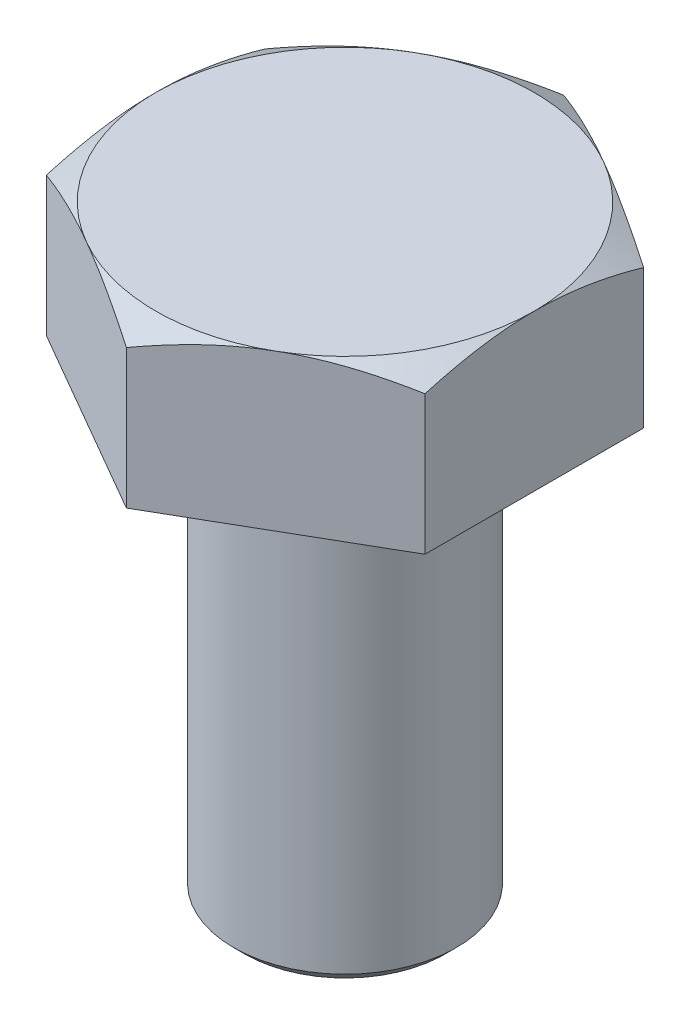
ISO-10303-21;
HEADER;
FILE_DESCRIPTION(('STEP AP214'),'2;1');
FILE_NAME('part.step','',(''),(''),'','','');
FILE_SCHEMA(('AUTOMOTIVE_DESIGN { 1 0 10303 214 1 1 1 1 }'));
ENDSEC;
DATA;
#1=APPLICATION_CONTEXT('core data for automotive mechanical design processes');
#2=APPLICATION_PROTOCOL_DEFINITION('international standard','automotive_design',2000,#1);
#3=PRODUCT_CONTEXT('',#1,'mechanical');
#4=PRODUCT('Part','Part','',(#3));
#5=PRODUCT_RELATED_PRODUCT_CATEGORY('part','',(#4));
#6=PRODUCT_DEFINITION_FORMATION('','',#4);
#7=PRODUCT_DEFINITION_CONTEXT('part definition',#1,'design');
#8=PRODUCT_DEFINITION('design','',#6,#7);
#9=PRODUCT_DEFINITION_SHAPE('','',#8);
#10=(LENGTH_UNIT() NAMED_UNIT(*) SI_UNIT(.MILLI.,.METRE.));
#11=(NAMED_UNIT(*) PLANE_ANGLE_UNIT() SI_UNIT($,.RADIAN.));
#12=(NAMED_UNIT(*) SI_UNIT($,.STERADIAN.) SOLID_ANGLE_UNIT());
#13=UNCERTAINTY_MEASURE_WITH_UNIT(LENGTH_MEASURE(1.E-05),#10,'distance_accuracy_value','');
#14=(GEOMETRIC_REPRESENTATION_CONTEXT(3) GLOBAL_UNCERTAINTY_ASSIGNED_CONTEXT((#13)) GLOBAL_UNIT_ASSIGNED_CONTEXT((#10,
#11,#12)) REPRESENTATION_CONTEXT('',''));
#15=CARTESIAN_POINT('',(0.,0.,0.));
#16=DIRECTION('',(0.,0.,1.));
#17=DIRECTION('',(1.,0.,0.));
#18=AXIS2_PLACEMENT_3D('',#15,#16,#17);
#19=CARTESIAN_POINT('',(8.49999999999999,7.,-4.90747728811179));
#20=DIRECTION('',(-0.5,0.,0.866025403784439));
#21=DIRECTION('',(0.866025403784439,0.,0.5));
#22=AXIS2_PLACEMENT_3D('',#19,#20,#21);
#23=PLANE('',#22);
#24=DIRECTION('',(0.,-1.,0.));
#25=VECTOR('',#24,1.);
#26=CARTESIAN_POINT('',(0.,7.,-9.81495457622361));
#27=LINE('',#26,#25);
#28=CARTESIAN_POINT('',(0.,6.24081062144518,-9.81495457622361));
#29=VERTEX_POINT('',#28);
#30=CARTESIAN_POINT('',(0.,0.,-9.81495457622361));
#31=VERTEX_POINT('',#30);
#32=EDGE_CURVE('E120',#29,#31,#27,.T.);
#33=ORIENTED_EDGE('',*,*,#32,.F.);
#34=CARTESIAN_POINT('',(-0.000200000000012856,6.24074395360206,-9.81507004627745));
#35=CARTESIAN_POINT('',(0.186639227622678,6.3030138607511,-9.70719836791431));
#36=CARTESIAN_POINT('',(0.374175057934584,6.36245770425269,-9.59892450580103));
#37=CARTESIAN_POINT('',(0.750769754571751,6.47491488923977,-9.38149745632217));
#38=CARTESIAN_POINT('',(0.939829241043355,6.52792545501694,-9.27234391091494));
#39=CARTESIAN_POINT('',(1.51003475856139,6.67626661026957,-8.9431356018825));
#40=CARTESIAN_POINT('',(1.89343164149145,6.76064107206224,-8.72178130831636));
#41=CARTESIAN_POINT('',(2.46717766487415,6.85957998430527,-8.39052888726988));
#42=CARTESIAN_POINT('',(2.65581276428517,6.88776480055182,-8.28162036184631));
#43=CARTESIAN_POINT('',(3.0339360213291,6.93502591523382,-8.06331079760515));
#44=CARTESIAN_POINT('',(3.22342410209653,6.95410301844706,-7.95390980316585));
#45=CARTESIAN_POINT('',(3.60272652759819,6.98266522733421,-7.73491944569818));
#46=CARTESIAN_POINT('',(3.79254025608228,6.99216121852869,-7.62533043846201));
#47=CARTESIAN_POINT('',(4.17234305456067,7.00135762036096,-7.40605119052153));
#48=CARTESIAN_POINT('',(4.36233211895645,7.00105833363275,-7.29636095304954));
#49=CARTESIAN_POINT('',(4.71752301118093,6.99134552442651,-7.09129139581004));
#50=CARTESIAN_POINT('',(4.88274990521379,6.98311683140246,-6.99589760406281));
#51=CARTESIAN_POINT('',(5.21281671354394,6.95941075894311,-6.80533344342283));
#52=CARTESIAN_POINT('',(5.37765660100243,6.94393289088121,-6.71016309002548));
#53=CARTESIAN_POINT('',(5.8715381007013,6.88699137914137,-6.42502047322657));
#54=CARTESIAN_POINT('',(6.1997055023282,6.8350269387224,-6.23555293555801));
#55=CARTESIAN_POINT('',(6.85952142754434,6.70511505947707,-5.85460803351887));
#56=CARTESIAN_POINT('',(7.19108574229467,6.62661693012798,-5.6631792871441));
#57=CARTESIAN_POINT('',(7.84926989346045,6.44845866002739,-5.28317649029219));
#58=CARTESIAN_POINT('',(8.17589815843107,6.34884036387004,-5.09459757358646));
#59=CARTESIAN_POINT('',(8.50019999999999,6.24074395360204,-4.90736181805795));
#60=B_SPLINE_CURVE_WITH_KNOTS('',3,(#34,#35,#36,#37,#38,#39,#40,#41,#42,#43,#44,#45,#46,#47,#48,
#49,#50,#51,#52,#53,#54,#55,#56,#57,#58,#59),.UNSPECIFIED.,.F.,.F.,(4,2,2,2,2,2,2,2,2,2,2,2,4),
(0.,0.673596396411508,1.34748239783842,2.69805431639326,3.356799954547,4.01548737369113,
4.67342558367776,5.33134346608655,5.90409556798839,6.47688628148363,7.62328361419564,
8.79510569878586,9.9646274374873),.UNSPECIFIED.);
#61=CARTESIAN_POINT('',(4.25000000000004,7.,-7.36121593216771));
#62=VERTEX_POINT('',#61);
#63=EDGE_CURVE('E104',#29,#62,#60,.T.);
#64=ORIENTED_EDGE('',*,*,#63,.T.);
#65=CARTESIAN_POINT('',(8.49999999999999,6.24081062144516,-4.90747728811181));
#66=VERTEX_POINT('',#65);
#67=EDGE_CURVE('E113',#62,#66,#60,.T.);
#68=ORIENTED_EDGE('',*,*,#67,.T.);
#69=DIRECTION('',(0.,-1.,0.));
#70=VECTOR('',#69,1.);
#71=CARTESIAN_POINT('',(8.49999999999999,7.,-4.90747728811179));
#72=LINE('',#71,#70);
#73=CARTESIAN_POINT('',(8.49999999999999,0.,-4.90747728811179));
#74=VERTEX_POINT('',#73);
#75=EDGE_CURVE('E358',#66,#74,#72,.T.);
#76=ORIENTED_EDGE('',*,*,#75,.T.);
#77=DIRECTION('',(-0.866025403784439,0.,-0.5));
#78=VECTOR('',#77,1.);
#79=CARTESIAN_POINT('',(8.49999999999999,0.,-4.90747728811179));
#80=LINE('',#79,#78);
#81=EDGE_CURVE('E127',#74,#31,#80,.T.);
#82=ORIENTED_EDGE('',*,*,#81,.T.);
#83=EDGE_LOOP('',(#33,#64,#68,#76,#82));
#84=FACE_BOUND('',#83,.T.);
#85=ADVANCED_FACE('F34',(#84),#23,.F.);
#86=CARTESIAN_POINT('',(0.,7.,-9.81495457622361));
#87=DIRECTION('',(0.5,0.,0.866025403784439));
#88=DIRECTION('',(0.866025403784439,0.,-0.5));
#89=AXIS2_PLACEMENT_3D('',#86,#87,#88);
#90=PLANE('',#89);
#91=DIRECTION('',(0.,-1.,0.));
#92=VECTOR('',#91,1.);
#93=CARTESIAN_POINT('',(-8.50000000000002,7.,-4.90747728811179));
#94=LINE('',#93,#92);
#95=CARTESIAN_POINT('',(-8.50000000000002,6.24081062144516,-4.90747728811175));
#96=VERTEX_POINT('',#95);
#97=CARTESIAN_POINT('',(-8.50000000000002,0.,-4.90747728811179));
#98=VERTEX_POINT('',#97);
#99=EDGE_CURVE('E129',#96,#98,#94,.T.);
#100=ORIENTED_EDGE('',*,*,#99,.F.);
#101=CARTESIAN_POINT('',(-8.50020000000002,6.24074395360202,-4.90736181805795));
#102=CARTESIAN_POINT('',(-8.31336077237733,6.30301386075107,-5.0152334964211));
#103=CARTESIAN_POINT('',(-8.12582494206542,6.36245770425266,-5.12350735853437));
#104=CARTESIAN_POINT('',(-7.74923024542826,6.47491488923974,-5.34093440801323));
#105=CARTESIAN_POINT('',(-7.56017075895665,6.52792545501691,-5.45008795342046));
#106=CARTESIAN_POINT('',(-6.98996524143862,6.67626661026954,-5.77929626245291));
#107=CARTESIAN_POINT('',(-6.60656835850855,6.76064107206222,-6.00065055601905));
#108=CARTESIAN_POINT('',(-6.03282233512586,6.85957998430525,-6.33190297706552));
#109=CARTESIAN_POINT('',(-5.84418723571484,6.88776480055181,-6.44081150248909));
#110=CARTESIAN_POINT('',(-5.46606397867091,6.9350259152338,-6.65912106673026));
#111=CARTESIAN_POINT('',(-5.27657589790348,6.95410301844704,-6.76852206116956));
#112=CARTESIAN_POINT('',(-4.89727347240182,6.9826652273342,-6.98751241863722));
#113=CARTESIAN_POINT('',(-4.70745974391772,6.99216121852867,-7.0971014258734));
#114=CARTESIAN_POINT('',(-4.32765694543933,7.00135762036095,-7.31638067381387));
#115=CARTESIAN_POINT('',(-4.13766788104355,7.00105833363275,-7.42607091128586));
#116=CARTESIAN_POINT('',(-3.78247698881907,6.9913455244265,-7.63114046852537));
#117=CARTESIAN_POINT('',(-3.61725009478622,6.98311683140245,-7.7265342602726));
#118=CARTESIAN_POINT('',(-3.28718328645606,6.95941075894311,-7.91709842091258));
#119=CARTESIAN_POINT('',(-3.12234339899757,6.94393289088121,-8.01226877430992));
#120=CARTESIAN_POINT('',(-2.6284618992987,6.88699137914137,-8.29741139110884));
#121=CARTESIAN_POINT('',(-2.3002944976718,6.83502693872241,-8.48687892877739));
#122=CARTESIAN_POINT('',(-1.64047857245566,6.70511505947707,-8.86782383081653));
#123=CARTESIAN_POINT('',(-1.30891425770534,6.62661693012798,-9.05925257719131));
#124=CARTESIAN_POINT('',(-0.65073010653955,6.44845866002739,-9.43925537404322));
#125=CARTESIAN_POINT('',(-0.324101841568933,6.34884036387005,-9.62783429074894));
#126=CARTESIAN_POINT('',(0.000199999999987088,6.24074395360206,-9.81507004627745));
#127=B_SPLINE_CURVE_WITH_KNOTS('',3,(#101,#102,#103,#104,#105,#106,#107,#108,#109,#110,#111,
#112,#113,#114,#115,#116,#117,#118,#119,#120,#121,#122,#123,#124,#125,#126),.UNSPECIFIED.,.F.,
.F.,(4,2,2,2,2,2,2,2,2,2,2,2,4),(0.,0.673596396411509,1.34748239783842,2.69805431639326,
3.356799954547,4.01548737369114,4.67342558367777,5.33134346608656,5.9040955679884,
6.47688628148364,7.62328361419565,8.79510569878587,9.96462743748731),.UNSPECIFIED.);
#128=CARTESIAN_POINT('',(-4.25000000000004,7.,-7.36121593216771));
#129=VERTEX_POINT('',#128);
#130=EDGE_CURVE('E122',#96,#129,#127,.T.);
#131=ORIENTED_EDGE('',*,*,#130,.T.);
#132=EDGE_CURVE('E57',#129,#29,#127,.T.);
#133=ORIENTED_EDGE('',*,*,#132,.T.);
#134=ORIENTED_EDGE('',*,*,#32,.T.);
#135=DIRECTION('',(-0.866025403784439,0.,0.5));
#136=VECTOR('',#135,1.);
#137=CARTESIAN_POINT('',(0.,0.,-9.81495457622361));
#138=LINE('',#137,#136);
#139=EDGE_CURVE('E367',#31,#98,#138,.T.);
#140=ORIENTED_EDGE('',*,*,#139,.T.);
#141=EDGE_LOOP('',(#100,#131,#133,#134,#140));
#142=FACE_BOUND('',#141,.T.);
#143=ADVANCED_FACE('F118',(#142),#90,.F.);
#144=CARTESIAN_POINT('',(-8.50000000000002,7.,-4.90747728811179));
#145=DIRECTION('',(1.,0.,0.));
#146=DIRECTION('',(0.,0.,-1.));
#147=AXIS2_PLACEMENT_3D('',#144,#145,#146);
#148=PLANE('',#147);
#149=DIRECTION('',(0.,-1.,0.));
#150=VECTOR('',#149,1.);
#151=CARTESIAN_POINT('',(-8.50000000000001,7.,4.90747728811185));
#152=LINE('',#151,#150);
#153=CARTESIAN_POINT('',(-8.49999999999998,6.24081062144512,4.90747728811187));
#154=VERTEX_POINT('',#153);
#155=CARTESIAN_POINT('',(-8.50000000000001,0.,4.90747728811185));
#156=VERTEX_POINT('',#155);
#157=EDGE_CURVE('E135',#154,#156,#152,.T.);
#158=ORIENTED_EDGE('',*,*,#157,.F.);
#159=CARTESIAN_POINT('',(-8.50000000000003,2.93252300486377,-13.0153529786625));
#160=CARTESIAN_POINT('',(-8.50000000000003,3.11287292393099,-12.6421549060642));
#161=CARTESIAN_POINT('',(-8.50000000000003,3.29143001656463,-12.2680744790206));
#162=CARTESIAN_POINT('',(-8.50000000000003,3.64393406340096,-11.5176718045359));
#163=CARTESIAN_POINT('',(-8.50000000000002,3.81788021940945,-11.1413491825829));
#164=CARTESIAN_POINT('',(-8.50000000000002,4.16105426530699,-10.3839521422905));
#165=CARTESIAN_POINT('',(-8.50000000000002,4.33024945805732,-10.0028628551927));
#166=CARTESIAN_POINT('',(-8.50000000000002,4.66137250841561,-9.23755213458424));
#167=CARTESIAN_POINT('',(-8.50000000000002,4.82330074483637,-8.85333086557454));
#168=CARTESIAN_POINT('',(-8.50000000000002,5.1398798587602,-8.07637493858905));
#169=CARTESIAN_POINT('',(-8.50000000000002,5.29441698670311,-7.68359367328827));
#170=CARTESIAN_POINT('',(-8.50000000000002,5.59138804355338,-6.89339929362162));
#171=CARTESIAN_POINT('',(-8.50000000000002,5.73382062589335,-6.49598566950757));
#172=CARTESIAN_POINT('',(-8.50000000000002,6.00275490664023,-5.69670564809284));
#173=CARTESIAN_POINT('',(-8.50000000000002,6.12929047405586,-5.29485077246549));
#174=CARTESIAN_POINT('',(-8.50000000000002,6.36232334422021,-4.48544256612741));
#175=CARTESIAN_POINT('',(-8.50000000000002,6.46882698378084,-4.07789108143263));
#176=CARTESIAN_POINT('',(-8.50000000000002,6.65661778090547,-3.25674318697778));
#177=CARTESIAN_POINT('',(-8.50000000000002,6.73789822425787,-2.84314519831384));
#178=CARTESIAN_POINT('',(-8.50000000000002,6.83683170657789,-2.21910871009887));
#179=CARTESIAN_POINT('',(-8.50000000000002,6.86598048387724,-2.01046436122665));
#180=CARTESIAN_POINT('',(-8.50000000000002,6.91604211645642,-1.59219744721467));
#181=CARTESIAN_POINT('',(-8.50000000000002,6.93695578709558,-1.38257498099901));
#182=CARTESIAN_POINT('',(-8.50000000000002,6.96998439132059,-0.963964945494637));
#183=CARTESIAN_POINT('',(-8.50000000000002,6.98215396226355,-0.754981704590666));
#184=CARTESIAN_POINT('',(-8.50000000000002,6.99763002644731,-0.33668741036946));
#185=CARTESIAN_POINT('',(-8.50000000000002,7.00093663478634,-0.127376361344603));
#186=CARTESIAN_POINT('',(-8.50000000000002,6.99860798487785,0.291137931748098));
#187=CARTESIAN_POINT('',(-8.50000000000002,6.99297523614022,0.500341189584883));
#188=CARTESIAN_POINT('',(-8.50000000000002,6.97290794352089,0.918327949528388));
#189=CARTESIAN_POINT('',(-8.50000000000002,6.95847296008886,1.12711143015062));
#190=CARTESIAN_POINT('',(-8.50000000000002,6.91312094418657,1.63313830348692));
#191=CARTESIAN_POINT('',(-8.50000000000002,6.87779367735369,1.92999290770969));
#192=CARTESIAN_POINT('',(-8.50000000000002,6.7913055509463,2.52142734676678));
#193=CARTESIAN_POINT('',(-8.50000000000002,6.7401403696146,2.81600653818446));
#194=CARTESIAN_POINT('',(-8.50000000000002,6.62379107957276,3.40264712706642));
#195=CARTESIAN_POINT('',(-8.50000000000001,6.55859371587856,3.69470587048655));
#196=CARTESIAN_POINT('',(-8.50000000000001,6.41616930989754,4.27581848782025));
#197=CARTESIAN_POINT('',(-8.50000000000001,6.33894340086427,4.56487264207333));
#198=CARTESIAN_POINT('',(-8.50000000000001,6.17229077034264,5.14709542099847));
#199=CARTESIAN_POINT('',(-8.50000000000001,6.08261138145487,5.44019122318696));
#200=CARTESIAN_POINT('',(-8.50000000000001,5.8943917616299,6.02328479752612));
#201=CARTESIAN_POINT('',(-8.50000000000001,5.79585764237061,6.31328455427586));
#202=CARTESIAN_POINT('',(-8.50000000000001,5.591963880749,6.8890223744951));
#203=CARTESIAN_POINT('',(-8.50000000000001,5.48664577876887,7.1747752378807));
#204=CARTESIAN_POINT('',(-8.50000000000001,5.26982800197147,7.74406391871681));
#205=CARTESIAN_POINT('',(-8.50000000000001,5.15832582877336,8.02759878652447));
#206=CARTESIAN_POINT('',(-8.50000000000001,5.04434336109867,8.310103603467));
#207=B_SPLINE_CURVE_WITH_KNOTS('',3,(#159,#160,#161,#162,#163,#164,#165,#166,#167,#168,#169,
#170,#171,#172,#173,#174,#175,#176,#177,#178,#179,#180,#181,#182,#183,#184,#185,#186,#187,#188,
#189,#190,#191,#192,#193,#194,#195,#196,#197,#198,#199,#200,#201,#202,#203,#204,#205,#206),
.UNSPECIFIED.,.F.,.F.,(4,2,2,2,2,2,2,2,2,2,2,2,2,2,2,2,2,2,2,2,2,2,2,4),(0.,1.24349005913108,
2.48719399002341,3.73801513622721,4.9887710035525,6.2548822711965,7.52113420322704,
8.7846408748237,10.0477471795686,11.3111894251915,11.9430642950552,12.5748765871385,
13.2027058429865,13.8305269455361,14.4581718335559,15.0858480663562,15.9821964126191,
16.878789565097,17.7762333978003,18.6735927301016,19.5929482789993,20.5116740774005,
21.4252286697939,22.339155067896),.UNSPECIFIED.);
#208=CARTESIAN_POINT('',(-8.50000000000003,6.99999999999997,0.));
#209=VERTEX_POINT('',#208);
#210=EDGE_CURVE('E368',#154,#209,#207,.F.);
#211=ORIENTED_EDGE('',*,*,#210,.T.);
#212=EDGE_CURVE('E49',#209,#96,#207,.F.);
#213=ORIENTED_EDGE('',*,*,#212,.T.);
#214=ORIENTED_EDGE('',*,*,#99,.T.);
#215=DIRECTION('',(0.,0.,1.));
#216=VECTOR('',#215,1.);
#217=CARTESIAN_POINT('',(-8.50000000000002,0.,-4.90747728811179));
#218=LINE('',#217,#216);
#219=EDGE_CURVE('E369',#98,#156,#218,.T.);
#220=ORIENTED_EDGE('',*,*,#219,.T.);
#221=EDGE_LOOP('',(#158,#211,#213,#214,#220));
#222=FACE_BOUND('',#221,.T.);
#223=ADVANCED_FACE('F216',(#222),#148,.F.);
#224=CARTESIAN_POINT('',(-8.50000000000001,7.,4.90747728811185));
#225=DIRECTION('',(0.5,0.,-0.866025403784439));
#226=DIRECTION('',(-0.866025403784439,0.,-0.5));
#227=AXIS2_PLACEMENT_3D('',#224,#225,#226);
#228=PLANE('',#227);
#229=DIRECTION('',(0.,-1.,0.));
#230=VECTOR('',#229,1.);
#231=CARTESIAN_POINT('',(0.,7.,9.81495457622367));
#232=LINE('',#231,#230);
#233=CARTESIAN_POINT('',(0.,6.2408106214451,9.81495457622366));
#234=VERTEX_POINT('',#233);
#235=CARTESIAN_POINT('',(0.,0.,9.81495457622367));
#236=VERTEX_POINT('',#235);
#237=EDGE_CURVE('E380',#234,#236,#232,.T.);
#238=ORIENTED_EDGE('',*,*,#237,.F.);
#239=CARTESIAN_POINT('',(0.000199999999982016,6.24074395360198,9.8150700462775));
#240=CARTESIAN_POINT('',(-0.18663922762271,6.30301386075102,9.70719836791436));
#241=CARTESIAN_POINT('',(-0.374175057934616,6.36245770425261,9.59892450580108));
#242=CARTESIAN_POINT('',(-0.750769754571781,6.47491488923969,9.38149745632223));
#243=CARTESIAN_POINT('',(-0.939829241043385,6.52792545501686,9.272343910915));
#244=CARTESIAN_POINT('',(-1.51003475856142,6.67626661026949,8.94313560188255));
#245=CARTESIAN_POINT('',(-1.89343164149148,6.76064107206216,8.72178130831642));
#246=CARTESIAN_POINT('',(-2.46717766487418,6.8595799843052,8.39052888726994));
#247=CARTESIAN_POINT('',(-2.6558127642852,6.88776480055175,8.28162036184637));
#248=CARTESIAN_POINT('',(-3.03393602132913,6.93502591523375,8.0633107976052));
#249=CARTESIAN_POINT('',(-3.22342410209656,6.95410301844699,7.9539098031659));
#250=CARTESIAN_POINT('',(-3.60272652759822,6.98266522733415,7.73491944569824));
#251=CARTESIAN_POINT('',(-3.79254025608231,6.99216121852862,7.62533043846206));
#252=CARTESIAN_POINT('',(-4.1723430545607,7.0013576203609,7.40605119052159));
#253=CARTESIAN_POINT('',(-4.36233211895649,7.00105833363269,7.2963609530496));
#254=CARTESIAN_POINT('',(-4.71752301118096,6.99134552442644,7.09129139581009));
#255=CARTESIAN_POINT('',(-4.88274990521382,6.98311683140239,6.99589760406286));
#256=CARTESIAN_POINT('',(-5.21281671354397,6.95941075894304,6.80533344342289));
#257=CARTESIAN_POINT('',(-5.37765660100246,6.94393289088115,6.71016309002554));
#258=CARTESIAN_POINT('',(-5.87153810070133,6.88699137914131,6.42502047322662));
#259=CARTESIAN_POINT('',(-6.19970550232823,6.83502693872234,6.23555293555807));
#260=CARTESIAN_POINT('',(-6.85952142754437,6.70511505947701,5.85460803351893));
#261=CARTESIAN_POINT('',(-7.19108574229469,6.62661693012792,5.66317928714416));
#262=CARTESIAN_POINT('',(-7.84926989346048,6.44845866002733,5.28317649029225));
#263=CARTESIAN_POINT('',(-8.1758981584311,6.34884036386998,5.09459757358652));
#264=CARTESIAN_POINT('',(-8.50020000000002,6.24074395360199,4.90736181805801));
#265=B_SPLINE_CURVE_WITH_KNOTS('',3,(#239,#240,#241,#242,#243,#244,#245,#246,#247,#248,#249,
#250,#251,#252,#253,#254,#255,#256,#257,#258,#259,#260,#261,#262,#263,#264),.UNSPECIFIED.,.F.,
.F.,(4,2,2,2,2,2,2,2,2,2,2,2,4),(0.,0.673596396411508,1.34748239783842,2.69805431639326,
3.356799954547,4.01548737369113,4.67342558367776,5.33134346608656,5.9040955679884,
6.47688628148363,7.62328361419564,8.79510569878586,9.9646274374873),.UNSPECIFIED.);
#266=CARTESIAN_POINT('',(-4.24999999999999,6.99999999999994,7.3612159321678));
#267=VERTEX_POINT('',#266);
#268=EDGE_CURVE('E123',#234,#267,#265,.T.);
#269=ORIENTED_EDGE('',*,*,#268,.T.);
#270=EDGE_CURVE('E384',#267,#154,#265,.T.);
#271=ORIENTED_EDGE('',*,*,#270,.T.);
#272=ORIENTED_EDGE('',*,*,#157,.T.);
#273=DIRECTION('',(0.866025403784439,0.,0.5));
#274=VECTOR('',#273,1.);
#275=CARTESIAN_POINT('',(-8.50000000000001,0.,4.90747728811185));
#276=LINE('',#275,#274);
#277=EDGE_CURVE('E375',#156,#236,#276,.T.);
#278=ORIENTED_EDGE('',*,*,#277,.T.);
#279=EDGE_LOOP('',(#238,#269,#271,#272,#278));
#280=FACE_BOUND('',#279,.T.);
#281=ADVANCED_FACE('F232',(#280),#228,.F.);
#282=CARTESIAN_POINT('',(0.,7.,9.81495457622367));
#283=DIRECTION('',(-0.5,0.,-0.866025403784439));
#284=DIRECTION('',(-0.866025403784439,0.,0.5));
#285=AXIS2_PLACEMENT_3D('',#282,#283,#284);
#286=PLANE('',#285);
#287=DIRECTION('',(0.,-1.,0.));
#288=VECTOR('',#287,1.);
#289=CARTESIAN_POINT('',(8.49999999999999,7.,4.90747728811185));
#290=LINE('',#289,#288);
#291=CARTESIAN_POINT('',(8.49999999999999,6.24081062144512,4.90747728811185));
#292=VERTEX_POINT('',#291);
#293=CARTESIAN_POINT('',(8.49999999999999,0.,4.90747728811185));
#294=VERTEX_POINT('',#293);
#295=EDGE_CURVE('E168',#292,#294,#290,.T.);
#296=ORIENTED_EDGE('',*,*,#295,.F.);
#297=CARTESIAN_POINT('',(8.50019999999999,6.240743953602,4.90736181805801));
#298=CARTESIAN_POINT('',(8.3133607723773,6.30301386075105,5.01523349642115));
#299=CARTESIAN_POINT('',(8.1258249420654,6.36245770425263,5.12350735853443));
#300=CARTESIAN_POINT('',(7.74923024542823,6.47491488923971,5.34093440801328));
#301=CARTESIAN_POINT('',(7.56017075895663,6.52792545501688,5.45008795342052));
#302=CARTESIAN_POINT('',(6.9899652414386,6.67626661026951,5.77929626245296));
#303=CARTESIAN_POINT('',(6.60656835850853,6.76064107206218,6.0006505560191));
#304=CARTESIAN_POINT('',(6.03282233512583,6.85957998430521,6.33190297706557));
#305=CARTESIAN_POINT('',(5.84418723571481,6.88776480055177,6.44081150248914));
#306=CARTESIAN_POINT('',(5.46606397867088,6.93502591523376,6.65912106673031));
#307=CARTESIAN_POINT('',(5.27657589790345,6.954103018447,6.76852206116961));
#308=CARTESIAN_POINT('',(4.89727347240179,6.98266522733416,6.98751241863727));
#309=CARTESIAN_POINT('',(4.7074597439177,6.99216121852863,7.09710142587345));
#310=CARTESIAN_POINT('',(4.32765694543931,7.0013576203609,7.31638067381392));
#311=CARTESIAN_POINT('',(4.13766788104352,7.0010583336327,7.42607091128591));
#312=CARTESIAN_POINT('',(3.78247698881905,6.99134552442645,7.63114046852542));
#313=CARTESIAN_POINT('',(3.61725009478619,6.9831168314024,7.72653426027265));
#314=CARTESIAN_POINT('',(3.28718328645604,6.95941075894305,7.91709842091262));
#315=CARTESIAN_POINT('',(3.12234339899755,6.94393289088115,8.01226877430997));
#316=CARTESIAN_POINT('',(2.62846189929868,6.88699137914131,8.29741139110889));
#317=CARTESIAN_POINT('',(2.30029449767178,6.83502693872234,8.48687892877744));
#318=CARTESIAN_POINT('',(1.64047857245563,6.70511505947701,8.86782383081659));
#319=CARTESIAN_POINT('',(1.30891425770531,6.62661693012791,9.05925257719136));
#320=CARTESIAN_POINT('',(0.650730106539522,6.44845866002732,9.43925537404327));
#321=CARTESIAN_POINT('',(0.324101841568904,6.34884036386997,9.627834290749));
#322=CARTESIAN_POINT('',(-0.000200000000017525,6.24074395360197,9.8150700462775));
#323=B_SPLINE_CURVE_WITH_KNOTS('',3,(#297,#298,#299,#300,#301,#302,#303,#304,#305,#306,#307,
#308,#309,#310,#311,#312,#313,#314,#315,#316,#317,#318,#319,#320,#321,#322),.UNSPECIFIED.,.F.,
.F.,(4,2,2,2,2,2,2,2,2,2,2,2,4),(0.,0.673596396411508,1.34748239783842,2.69805431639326,
3.356799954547,4.01548737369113,4.67342558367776,5.33134346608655,5.90409556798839,
6.47688628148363,7.62328361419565,8.79510569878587,9.96462743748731),.UNSPECIFIED.);
#324=CARTESIAN_POINT('',(4.24999999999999,6.99999999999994,7.3612159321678));
#325=VERTEX_POINT('',#324);
#326=EDGE_CURVE('E150',#292,#325,#323,.T.);
#327=ORIENTED_EDGE('',*,*,#326,.T.);
#328=EDGE_CURVE('E112',#325,#234,#323,.T.);
#329=ORIENTED_EDGE('',*,*,#328,.T.);
#330=ORIENTED_EDGE('',*,*,#237,.T.);
#331=DIRECTION('',(0.866025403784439,0.,-0.5));
#332=VECTOR('',#331,1.);
#333=CARTESIAN_POINT('',(0.,0.,9.81495457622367));
#334=LINE('',#333,#332);
#335=EDGE_CURVE('E364',#236,#294,#334,.T.);
#336=ORIENTED_EDGE('',*,*,#335,.T.);
#337=EDGE_LOOP('',(#296,#327,#329,#330,#336));
#338=FACE_BOUND('',#337,.T.);
#339=ADVANCED_FACE('F166',(#338),#286,.F.);
#340=CARTESIAN_POINT('',(8.49999999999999,7.,4.90747728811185));
#341=DIRECTION('',(-1.,0.,0.));
#342=DIRECTION('',(0.,0.,1.));
#343=AXIS2_PLACEMENT_3D('',#340,#341,#342);
#344=PLANE('',#343);
#345=ORIENTED_EDGE('',*,*,#75,.F.);
#346=CARTESIAN_POINT('',(8.49999999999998,2.93252300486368,-13.0153529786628));
#347=CARTESIAN_POINT('',(8.49999999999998,3.1128729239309,-12.6421549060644));
#348=CARTESIAN_POINT('',(8.49999999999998,3.29143001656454,-12.2680744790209));
#349=CARTESIAN_POINT('',(8.49999999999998,3.64393406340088,-11.5176718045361));
#350=CARTESIAN_POINT('',(8.49999999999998,3.81788021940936,-11.1413491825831));
#351=CARTESIAN_POINT('',(8.49999999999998,4.16105426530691,-10.3839521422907));
#352=CARTESIAN_POINT('',(8.49999999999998,4.33024945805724,-10.0028628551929));
#353=CARTESIAN_POINT('',(8.49999999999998,4.66137250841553,-9.23755213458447));
#354=CARTESIAN_POINT('',(8.49999999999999,4.82330074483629,-8.85333086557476));
#355=CARTESIAN_POINT('',(8.49999999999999,5.13987985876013,-8.07637493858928));
#356=CARTESIAN_POINT('',(8.49999999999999,5.29441698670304,-7.6835936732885));
#357=CARTESIAN_POINT('',(8.49999999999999,5.59138804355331,-6.89339929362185));
#358=CARTESIAN_POINT('',(8.49999999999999,5.73382062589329,-6.4959856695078));
#359=CARTESIAN_POINT('',(8.49999999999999,6.00275490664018,-5.69670564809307));
#360=CARTESIAN_POINT('',(8.49999999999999,6.12929047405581,-5.29485077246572));
#361=CARTESIAN_POINT('',(8.49999999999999,6.36232334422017,-4.48544256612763));
#362=CARTESIAN_POINT('',(8.49999999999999,6.4688269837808,-4.07789108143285));
#363=CARTESIAN_POINT('',(8.49999999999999,6.65661778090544,-3.256743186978));
#364=CARTESIAN_POINT('',(8.49999999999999,6.73789822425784,-2.84314519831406));
#365=CARTESIAN_POINT('',(8.49999999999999,6.83683170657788,-2.21910871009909));
#366=CARTESIAN_POINT('',(8.49999999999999,6.86598048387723,-2.01046436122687));
#367=CARTESIAN_POINT('',(8.49999999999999,6.91604211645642,-1.59219744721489));
#368=CARTESIAN_POINT('',(8.49999999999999,6.93695578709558,-1.38257498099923));
#369=CARTESIAN_POINT('',(8.49999999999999,6.9699843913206,-0.963964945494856));
#370=CARTESIAN_POINT('',(8.49999999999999,6.98215396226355,-0.754981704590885));
#371=CARTESIAN_POINT('',(8.49999999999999,6.99763002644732,-0.336687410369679));
#372=CARTESIAN_POINT('',(8.49999999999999,7.00093663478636,-0.127376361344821));
#373=CARTESIAN_POINT('',(8.49999999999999,6.99860798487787,0.291137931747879));
#374=CARTESIAN_POINT('',(8.49999999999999,6.99297523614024,0.500341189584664));
#375=CARTESIAN_POINT('',(8.49999999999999,6.97290794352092,0.918327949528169));
#376=CARTESIAN_POINT('',(8.49999999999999,6.95847296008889,1.1271114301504));
#377=CARTESIAN_POINT('',(8.49999999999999,6.91312094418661,1.6331383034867));
#378=CARTESIAN_POINT('',(8.49999999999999,6.87779367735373,1.92999290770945));
#379=CARTESIAN_POINT('',(8.49999999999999,6.79130555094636,2.52142734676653));
#380=CARTESIAN_POINT('',(8.49999999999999,6.74014036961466,2.8160065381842));
#381=CARTESIAN_POINT('',(8.49999999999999,6.62379107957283,3.40264712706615));
#382=CARTESIAN_POINT('',(8.49999999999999,6.55859371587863,3.69470587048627));
#383=CARTESIAN_POINT('',(8.49999999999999,6.41616930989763,4.27581848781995));
#384=CARTESIAN_POINT('',(8.49999999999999,6.33894340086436,4.56487264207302));
#385=CARTESIAN_POINT('',(8.49999999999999,6.17229077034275,5.14709542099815));
#386=CARTESIAN_POINT('',(8.49999999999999,6.08261138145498,5.44019122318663));
#387=CARTESIAN_POINT('',(8.49999999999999,5.89439176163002,6.02328479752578));
#388=CARTESIAN_POINT('',(8.49999999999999,5.79585764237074,6.31328455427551));
#389=CARTESIAN_POINT('',(8.49999999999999,5.59196388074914,6.88902237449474));
#390=CARTESIAN_POINT('',(8.49999999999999,5.48664577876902,7.17477523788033));
#391=CARTESIAN_POINT('',(8.49999999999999,5.26982800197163,7.74406391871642));
#392=CARTESIAN_POINT('',(8.49999999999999,5.15832582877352,8.02759878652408));
#393=CARTESIAN_POINT('',(8.49999999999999,5.04434336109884,8.31010360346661));
#394=B_SPLINE_CURVE_WITH_KNOTS('',3,(#346,#347,#348,#349,#350,#351,#352,#353,#354,#355,#356,
#357,#358,#359,#360,#361,#362,#363,#364,#365,#366,#367,#368,#369,#370,#371,#372,#373,#374,#375,
#376,#377,#378,#379,#380,#381,#382,#383,#384,#385,#386,#387,#388,#389,#390,#391,#392,#393),
.UNSPECIFIED.,.F.,.F.,(4,2,2,2,2,2,2,2,2,2,2,2,2,2,2,2,2,2,2,2,2,2,2,4),(0.,1.24349005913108,
2.48719399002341,3.73801513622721,4.9887710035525,6.25488227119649,7.52113420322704,
8.78464087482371,10.0477471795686,11.3111894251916,11.9430642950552,12.5748765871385,
13.2027058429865,13.8305269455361,14.4581718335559,15.0858480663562,15.9821964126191,
16.8787895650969,17.7762333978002,18.6735927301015,19.5929482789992,20.5116740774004,
21.4252286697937,22.3391550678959),.UNSPECIFIED.);
#395=CARTESIAN_POINT('',(8.50000000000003,6.99999999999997,0.));
#396=VERTEX_POINT('',#395);
#397=EDGE_CURVE('E169',#66,#396,#394,.T.);
#398=ORIENTED_EDGE('',*,*,#397,.T.);
#399=EDGE_CURVE('E152',#396,#292,#394,.T.);
#400=ORIENTED_EDGE('',*,*,#399,.T.);
#401=ORIENTED_EDGE('',*,*,#295,.T.);
#402=DIRECTION('',(0.,0.,-1.));
#403=VECTOR('',#402,1.);
#404=CARTESIAN_POINT('',(8.49999999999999,0.,4.90747728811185));
#405=LINE('',#404,#403);
#406=EDGE_CURVE('E359',#294,#74,#405,.T.);
#407=ORIENTED_EDGE('',*,*,#406,.T.);
#408=EDGE_LOOP('',(#345,#398,#400,#401,#407));
#409=FACE_BOUND('',#408,.T.);
#410=ADVANCED_FACE('F245',(#409),#344,.F.);
#411=CARTESIAN_POINT('',(0.,0.,0.));
#412=DIRECTION('',(0.,1.,0.));
#413=DIRECTION('',(0.,0.,1.));
#414=AXIS2_PLACEMENT_3D('',#411,#412,#413);
#415=PLANE('',#414);
#416=CARTESIAN_POINT('',(0.,0.,0.));
#417=DIRECTION('',(0.,1.,0.));
#418=DIRECTION('',(0.,0.,1.));
#419=AXIS2_PLACEMENT_3D('',#416,#417,#418);
#420=CIRCLE('',#419,5.);
#421=CARTESIAN_POINT('',(0.,0.,5.));
#422=VERTEX_POINT('',#421);
#423=EDGE_CURVE('E353',#422,#422,#420,.T.);
#424=ORIENTED_EDGE('',*,*,#423,.T.);
#425=EDGE_LOOP('',(#424));
#426=FACE_BOUND('',#425,.T.);
#427=ORIENTED_EDGE('',*,*,#81,.F.);
#428=ORIENTED_EDGE('',*,*,#406,.F.);
#429=ORIENTED_EDGE('',*,*,#335,.F.);
#430=ORIENTED_EDGE('',*,*,#277,.F.);
#431=ORIENTED_EDGE('',*,*,#219,.F.);
#432=ORIENTED_EDGE('',*,*,#139,.F.);
#433=EDGE_LOOP('',(#427,#428,#429,#430,#431,#432));
#434=FACE_BOUND('',#433,.T.);
#435=ADVANCED_FACE('F251',(#426,#434),#415,.F.);
#436=CARTESIAN_POINT('',(0.,6.99999999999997,0.));
#437=DIRECTION('',(0.,-1.,0.));
#438=DIRECTION('',(0.,0.,-1.));
#439=AXIS2_PLACEMENT_3D('',#436,#437,#438);
#440=CONICAL_SURFACE('',#439,8.50000000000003,1.0471975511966);
#441=ORIENTED_EDGE('',*,*,#328,.F.);
#442=CARTESIAN_POINT('',(0.,7.,0.));
#443=DIRECTION('',(0.,1.,0.));
#444=DIRECTION('',(0.,0.,1.));
#445=AXIS2_PLACEMENT_3D('',#442,#443,#444);
#446=CIRCLE('',#445,8.49999999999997);
#447=EDGE_CURVE('E128',#325,#267,#446,.F.);
#448=ORIENTED_EDGE('',*,*,#447,.T.);
#449=ORIENTED_EDGE('',*,*,#268,.F.);
#450=EDGE_LOOP('',(#441,#448,#449));
#451=FACE_BOUND('',#450,.T.);
#452=ADVANCED_FACE('F159',(#451),#440,.T.);
#453=ORIENTED_EDGE('',*,*,#399,.F.);
#454=EDGE_CURVE('E132',#396,#325,#446,.F.);
#455=ORIENTED_EDGE('',*,*,#454,.T.);
#456=ORIENTED_EDGE('',*,*,#326,.F.);
#457=EDGE_LOOP('',(#453,#455,#456));
#458=FACE_BOUND('',#457,.T.);
#459=ADVANCED_FACE('F148',(#458),#440,.T.);
#460=CARTESIAN_POINT('',(0.,6.99999999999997,0.));
#461=DIRECTION('',(0.,-1.,0.));
#462=DIRECTION('',(0.,0.,-1.));
#463=AXIS2_PLACEMENT_3D('',#460,#461,#462);
#464=CIRCLE('',#463,8.50000000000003);
#465=EDGE_CURVE('E354',#62,#396,#464,.T.);
#466=ORIENTED_EDGE('',*,*,#465,.T.);
#467=ORIENTED_EDGE('',*,*,#397,.F.);
#468=ORIENTED_EDGE('',*,*,#67,.F.);
#469=EDGE_LOOP('',(#466,#467,#468));
#470=FACE_BOUND('',#469,.T.);
#471=ADVANCED_FACE('F266',(#470),#440,.T.);
#472=EDGE_CURVE('E107',#129,#62,#446,.F.);
#473=ORIENTED_EDGE('',*,*,#472,.T.);
#474=ORIENTED_EDGE('',*,*,#63,.F.);
#475=ORIENTED_EDGE('',*,*,#132,.F.);
#476=EDGE_LOOP('',(#473,#474,#475));
#477=FACE_BOUND('',#476,.T.);
#478=ADVANCED_FACE('F105',(#477),#440,.T.);
#479=EDGE_CURVE('E141',#209,#129,#446,.F.);
#480=ORIENTED_EDGE('',*,*,#479,.T.);
#481=ORIENTED_EDGE('',*,*,#130,.F.);
#482=ORIENTED_EDGE('',*,*,#212,.F.);
#483=EDGE_LOOP('',(#480,#481,#482));
#484=FACE_BOUND('',#483,.T.);
#485=ADVANCED_FACE('F192',(#484),#440,.T.);
#486=ORIENTED_EDGE('',*,*,#270,.F.);
#487=EDGE_CURVE('E134',#267,#209,#446,.F.);
#488=ORIENTED_EDGE('',*,*,#487,.T.);
#489=ORIENTED_EDGE('',*,*,#210,.F.);
#490=EDGE_LOOP('',(#486,#488,#489));
#491=FACE_BOUND('',#490,.T.);
#492=ADVANCED_FACE('F187',(#491),#440,.T.);
#493=CARTESIAN_POINT('',(0.,7.,0.));
#494=DIRECTION('',(0.,1.,0.));
#495=DIRECTION('',(0.,0.,1.));
#496=AXIS2_PLACEMENT_3D('',#493,#494,#495);
#497=PLANE('',#496);
#498=ORIENTED_EDGE('',*,*,#487,.F.);
#499=ORIENTED_EDGE('',*,*,#447,.F.);
#500=ORIENTED_EDGE('',*,*,#454,.F.);
#501=ORIENTED_EDGE('',*,*,#465,.F.);
#502=ORIENTED_EDGE('',*,*,#472,.F.);
#503=ORIENTED_EDGE('',*,*,#479,.F.);
#504=EDGE_LOOP('',(#498,#499,#500,#501,#502,#503));
#505=FACE_BOUND('',#504,.T.);
#506=ADVANCED_FACE('F164',(#505),#497,.T.);
#507=CARTESIAN_POINT('',(0.,-20.,0.));
#508=DIRECTION('',(0.,1.,0.));
#509=DIRECTION('',(0.,0.,1.));
#510=AXIS2_PLACEMENT_3D('',#507,#508,#509);
#511=CYLINDRICAL_SURFACE('',#510,5.);
#512=CARTESIAN_POINT('',(0.,-19.5,0.));
#513=DIRECTION('',(0.,1.,0.));
#514=DIRECTION('',(0.,0.,1.));
#515=AXIS2_PLACEMENT_3D('',#512,#513,#514);
#516=CIRCLE('',#515,5.);
#517=CARTESIAN_POINT('',(0.,-19.5,5.));
#518=VERTEX_POINT('',#517);
#519=EDGE_CURVE('E42',#518,#518,#516,.T.);
#520=ORIENTED_EDGE('',*,*,#519,.T.);
#521=EDGE_LOOP('',(#520));
#522=FACE_BOUND('',#521,.T.);
#523=ORIENTED_EDGE('',*,*,#423,.F.);
#524=EDGE_LOOP('',(#523));
#525=FACE_BOUND('',#524,.T.);
#526=ADVANCED_FACE('F193',(#522,#525),#511,.T.);
#527=CARTESIAN_POINT('',(0.,-20.,0.));
#528=DIRECTION('',(0.,1.,0.));
#529=DIRECTION('',(0.,0.,1.));
#530=AXIS2_PLACEMENT_3D('',#527,#528,#529);
#531=PLANE('',#530);
#532=CARTESIAN_POINT('',(0.,-20.,0.));
#533=DIRECTION('',(0.,1.,0.));
#534=DIRECTION('',(0.,0.,1.));
#535=AXIS2_PLACEMENT_3D('',#532,#533,#534);
#536=CIRCLE('',#535,4.49999999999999);
#537=CARTESIAN_POINT('',(0.,-20.,4.49999999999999));
#538=VERTEX_POINT('',#537);
#539=EDGE_CURVE('E11',#538,#538,#536,.F.);
#540=ORIENTED_EDGE('',*,*,#539,.T.);
#541=EDGE_LOOP('',(#540));
#542=FACE_BOUND('',#541,.T.);
#543=ADVANCED_FACE('F300',(#542),#531,.F.);
#544=CARTESIAN_POINT('',(0.,-19.5,0.));
#545=DIRECTION('',(0.,1.,0.));
#546=DIRECTION('',(0.,0.,1.));
#547=AXIS2_PLACEMENT_3D('',#544,#545,#546);
#548=CONICAL_SURFACE('',#547,5.,0.785398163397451);
#549=ORIENTED_EDGE('',*,*,#539,.F.);
#550=EDGE_LOOP('',(#549));
#551=FACE_BOUND('',#550,.T.);
#552=ORIENTED_EDGE('',*,*,#519,.F.);
#553=EDGE_LOOP('',(#552));
#554=FACE_BOUND('',#553,.T.);
#555=ADVANCED_FACE('F36',(#551,#554),#548,.T.);
#556=CLOSED_SHELL('',(#85,#143,#223,#281,#339,#410,#435,#452,#459,#471,#478,#485,#492,#506,#526,
#543,#555));
#557=MANIFOLD_SOLID_BREP('B2',#556);
#558=ADVANCED_BREP_SHAPE_REPRESENTATION('',(#18,#557),#14);
#559=SHAPE_DEFINITION_REPRESENTATION(#9,#558);
ENDSEC;
END-ISO-10303-21;
